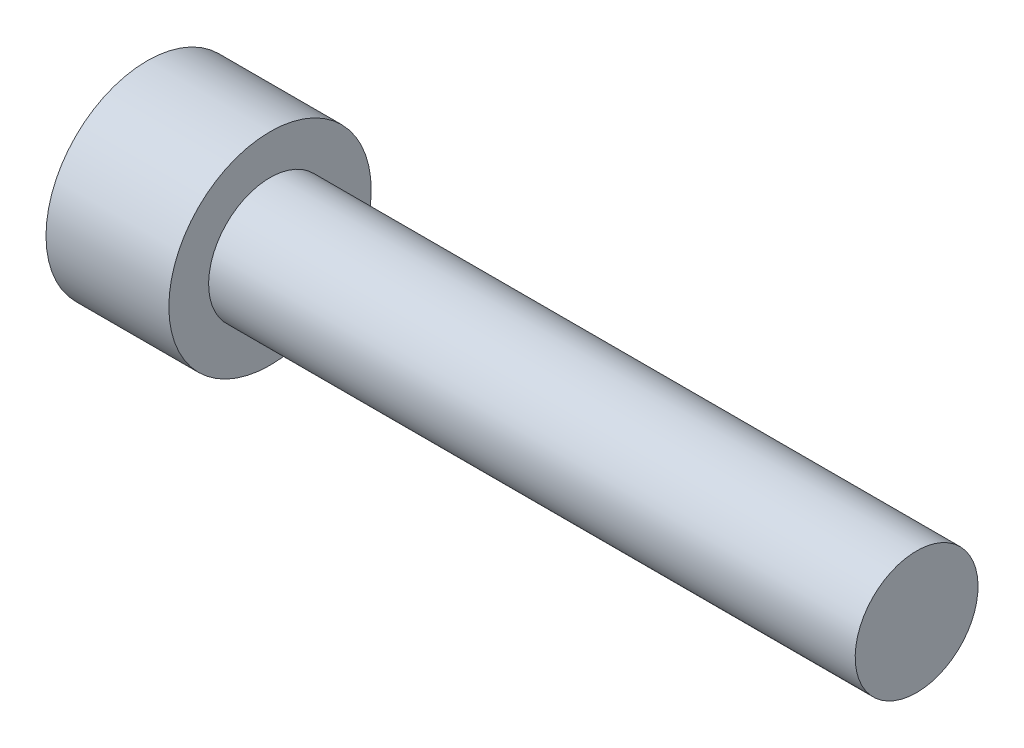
ISO-10303-21;
HEADER;
FILE_DESCRIPTION(('STEP AP214'),'2;1');
FILE_NAME('part.step','',(''),(''),'','','');
FILE_SCHEMA(('AUTOMOTIVE_DESIGN { 1 0 10303 214 1 1 1 1 }'));
ENDSEC;
DATA;
#1=APPLICATION_CONTEXT('core data for automotive mechanical design processes');
#2=APPLICATION_PROTOCOL_DEFINITION('international standard','automotive_design',2000,#1);
#3=PRODUCT_CONTEXT('',#1,'mechanical');
#4=PRODUCT('Part','Part','',(#3));
#5=PRODUCT_RELATED_PRODUCT_CATEGORY('part','',(#4));
#6=PRODUCT_DEFINITION_FORMATION('','',#4);
#7=PRODUCT_DEFINITION_CONTEXT('part definition',#1,'design');
#8=PRODUCT_DEFINITION('design','',#6,#7);
#9=PRODUCT_DEFINITION_SHAPE('','',#8);
#10=(LENGTH_UNIT() NAMED_UNIT(*) SI_UNIT(.MILLI.,.METRE.));
#11=(NAMED_UNIT(*) PLANE_ANGLE_UNIT() SI_UNIT($,.RADIAN.));
#12=(NAMED_UNIT(*) SI_UNIT($,.STERADIAN.) SOLID_ANGLE_UNIT());
#13=UNCERTAINTY_MEASURE_WITH_UNIT(LENGTH_MEASURE(1.E-05),#10,'distance_accuracy_value','');
#14=(GEOMETRIC_REPRESENTATION_CONTEXT(3) GLOBAL_UNCERTAINTY_ASSIGNED_CONTEXT((#13)) GLOBAL_UNIT_ASSIGNED_CONTEXT((#10,
#11,#12)) REPRESENTATION_CONTEXT('',''));
#15=CARTESIAN_POINT('',(0.,0.,0.));
#16=DIRECTION('',(0.,0.,1.));
#17=DIRECTION('',(1.,0.,0.));
#18=AXIS2_PLACEMENT_3D('',#15,#16,#17);
#19=CARTESIAN_POINT('',(30.226,0.,0.));
#20=DIRECTION('',(-1.,0.,0.));
#21=DIRECTION('',(0.,-1.,0.));
#22=AXIS2_PLACEMENT_3D('',#19,#20,#21);
#23=PLANE('',#22);
#24=CARTESIAN_POINT('',(30.226,0.,0.));
#25=DIRECTION('',(-1.,0.,0.));
#26=DIRECTION('',(0.,-1.,0.));
#27=AXIS2_PLACEMENT_3D('',#24,#25,#26);
#28=CIRCLE('',#27,2.413);
#29=CARTESIAN_POINT('',(30.226,-2.413,0.));
#30=VERTEX_POINT('',#29);
#31=EDGE_CURVE('E11',#30,#30,#28,.T.);
#32=ORIENTED_EDGE('',*,*,#31,.F.);
#33=EDGE_LOOP('',(#32));
#34=FACE_BOUND('',#33,.T.);
#35=ADVANCED_FACE('F28',(#34),#23,.F.);
#36=CARTESIAN_POINT('',(0.,0.,0.));
#37=DIRECTION('',(-1.,0.,0.));
#38=DIRECTION('',(0.,-1.,0.));
#39=AXIS2_PLACEMENT_3D('',#36,#37,#38);
#40=CYLINDRICAL_SURFACE('',#39,2.413);
#41=CARTESIAN_POINT('',(4.826,0.,0.));
#42=DIRECTION('',(-1.,0.,0.));
#43=DIRECTION('',(0.,-1.,0.));
#44=AXIS2_PLACEMENT_3D('',#41,#42,#43);
#45=CIRCLE('',#44,2.413);
#46=CARTESIAN_POINT('',(4.826,-2.413,0.));
#47=VERTEX_POINT('',#46);
#48=EDGE_CURVE('E35',#47,#47,#45,.T.);
#49=ORIENTED_EDGE('',*,*,#48,.F.);
#50=EDGE_LOOP('',(#49));
#51=FACE_BOUND('',#50,.T.);
#52=ORIENTED_EDGE('',*,*,#31,.T.);
#53=EDGE_LOOP('',(#52));
#54=FACE_BOUND('',#53,.T.);
#55=ADVANCED_FACE('F146',(#51,#54),#40,.T.);
#56=CARTESIAN_POINT('',(4.826,3.9751,0.));
#57=DIRECTION('',(-1.,0.,0.));
#58=DIRECTION('',(0.,-1.,0.));
#59=AXIS2_PLACEMENT_3D('',#56,#57,#58);
#60=PLANE('',#59);
#61=CARTESIAN_POINT('',(4.826,0.,0.));
#62=DIRECTION('',(-1.,0.,0.));
#63=DIRECTION('',(0.,-1.,0.));
#64=AXIS2_PLACEMENT_3D('',#61,#62,#63);
#65=CIRCLE('',#64,3.9751);
#66=CARTESIAN_POINT('',(4.826,-3.9751,0.));
#67=VERTEX_POINT('',#66);
#68=EDGE_CURVE('E139',#67,#67,#65,.T.);
#69=ORIENTED_EDGE('',*,*,#68,.F.);
#70=EDGE_LOOP('',(#69));
#71=FACE_BOUND('',#70,.T.);
#72=ORIENTED_EDGE('',*,*,#48,.T.);
#73=EDGE_LOOP('',(#72));
#74=FACE_BOUND('',#73,.T.);
#75=ADVANCED_FACE('F144',(#71,#74),#60,.F.);
#76=CARTESIAN_POINT('',(0.,0.,0.));
#77=DIRECTION('',(-1.,0.,0.));
#78=DIRECTION('',(0.,-1.,0.));
#79=AXIS2_PLACEMENT_3D('',#76,#77,#78);
#80=CYLINDRICAL_SURFACE('',#79,3.9751);
#81=CARTESIAN_POINT('',(0.,0.,0.));
#82=DIRECTION('',(-1.,0.,0.));
#83=DIRECTION('',(0.,-1.,0.));
#84=AXIS2_PLACEMENT_3D('',#81,#82,#83);
#85=CIRCLE('',#84,3.9751);
#86=CARTESIAN_POINT('',(0.,-3.9751,0.));
#87=VERTEX_POINT('',#86);
#88=EDGE_CURVE('E130',#87,#87,#85,.T.);
#89=ORIENTED_EDGE('',*,*,#88,.F.);
#90=EDGE_LOOP('',(#89));
#91=FACE_BOUND('',#90,.T.);
#92=ORIENTED_EDGE('',*,*,#68,.T.);
#93=EDGE_LOOP('',(#92));
#94=FACE_BOUND('',#93,.T.);
#95=ADVANCED_FACE('F164',(#91,#94),#80,.T.);
#96=CARTESIAN_POINT('',(0.,0.,0.));
#97=DIRECTION('',(1.,0.,0.));
#98=DIRECTION('',(0.,1.,0.));
#99=AXIS2_PLACEMENT_3D('',#96,#97,#98);
#100=PLANE('',#99);
#101=DIRECTION('',(0.,0.866025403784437,-0.500000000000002));
#102=VECTOR('',#101,1.);
#103=CARTESIAN_POINT('',(0.,1.9812,1.14384635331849));
#104=LINE('',#103,#102);
#105=CARTESIAN_POINT('',(0.,0.,2.28769270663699));
#106=VERTEX_POINT('',#105);
#107=CARTESIAN_POINT('',(0.,1.9812,1.14384635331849));
#108=VERTEX_POINT('',#107);
#109=EDGE_CURVE('E96',#106,#108,#104,.T.);
#110=ORIENTED_EDGE('',*,*,#109,.F.);
#111=DIRECTION('',(0.,0.866025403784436,0.500000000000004));
#112=VECTOR('',#111,1.);
#113=CARTESIAN_POINT('',(0.,-1.9812,1.14384635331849));
#114=LINE('',#113,#112);
#115=CARTESIAN_POINT('',(0.,-1.9812,1.14384635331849));
#116=VERTEX_POINT('',#115);
#117=EDGE_CURVE('E42',#116,#106,#114,.T.);
#118=ORIENTED_EDGE('',*,*,#117,.F.);
#119=DIRECTION('',(0.,0.,1.));
#120=VECTOR('',#119,1.);
#121=CARTESIAN_POINT('',(0.,-1.9812,1.14384635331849));
#122=LINE('',#121,#120);
#123=CARTESIAN_POINT('',(0.,-1.9812,-1.14384635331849));
#124=VERTEX_POINT('',#123);
#125=EDGE_CURVE('E112',#124,#116,#122,.T.);
#126=ORIENTED_EDGE('',*,*,#125,.F.);
#127=DIRECTION('',(0.,-0.866025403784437,0.500000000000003));
#128=VECTOR('',#127,1.);
#129=CARTESIAN_POINT('',(0.,-1.9812,-1.14384635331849));
#130=LINE('',#129,#128);
#131=CARTESIAN_POINT('',(0.,0.,-2.28769270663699));
#132=VERTEX_POINT('',#131);
#133=EDGE_CURVE('E106',#132,#124,#130,.T.);
#134=ORIENTED_EDGE('',*,*,#133,.F.);
#135=DIRECTION('',(0.,-0.866025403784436,-0.500000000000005));
#136=VECTOR('',#135,1.);
#137=CARTESIAN_POINT('',(0.,1.9812,-1.14384635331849));
#138=LINE('',#137,#136);
#139=CARTESIAN_POINT('',(0.,1.9812,-1.14384635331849));
#140=VERTEX_POINT('',#139);
#141=EDGE_CURVE('E104',#140,#132,#138,.T.);
#142=ORIENTED_EDGE('',*,*,#141,.F.);
#143=DIRECTION('',(0.,0.,-1.));
#144=VECTOR('',#143,1.);
#145=CARTESIAN_POINT('',(0.,1.9812,1.14384635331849));
#146=LINE('',#145,#144);
#147=EDGE_CURVE('E85',#108,#140,#146,.T.);
#148=ORIENTED_EDGE('',*,*,#147,.F.);
#149=EDGE_LOOP('',(#110,#118,#126,#134,#142,#148));
#150=FACE_BOUND('',#149,.T.);
#151=ORIENTED_EDGE('',*,*,#88,.T.);
#152=EDGE_LOOP('',(#151));
#153=FACE_BOUND('',#152,.T.);
#154=ADVANCED_FACE('F100',(#150,#153),#100,.F.);
#155=CARTESIAN_POINT('',(2.54,-1.9812,1.14384635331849));
#156=DIRECTION('',(0.,-0.500000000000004,0.866025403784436));
#157=DIRECTION('',(0.,-0.866025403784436,-0.500000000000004));
#158=AXIS2_PLACEMENT_3D('',#155,#156,#157);
#159=PLANE('',#158);
#160=ORIENTED_EDGE('',*,*,#117,.T.);
#161=DIRECTION('',(-1.,0.,0.));
#162=VECTOR('',#161,1.);
#163=CARTESIAN_POINT('',(2.54,0.,2.28769270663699));
#164=LINE('',#163,#162);
#165=CARTESIAN_POINT('',(2.54,0.,2.28769270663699));
#166=VERTEX_POINT('',#165);
#167=EDGE_CURVE('E93',#166,#106,#164,.T.);
#168=ORIENTED_EDGE('',*,*,#167,.F.);
#169=DIRECTION('',(0.,0.866025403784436,0.500000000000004));
#170=VECTOR('',#169,1.);
#171=CARTESIAN_POINT('',(2.54,-1.9812,1.14384635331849));
#172=LINE('',#171,#170);
#173=CARTESIAN_POINT('',(2.54,-1.9812,1.14384635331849));
#174=VERTEX_POINT('',#173);
#175=EDGE_CURVE('E114',#174,#166,#172,.T.);
#176=ORIENTED_EDGE('',*,*,#175,.F.);
#177=DIRECTION('',(-1.,0.,0.));
#178=VECTOR('',#177,1.);
#179=CARTESIAN_POINT('',(2.54,-1.9812,1.14384635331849));
#180=LINE('',#179,#178);
#181=EDGE_CURVE('E49',#174,#116,#180,.T.);
#182=ORIENTED_EDGE('',*,*,#181,.T.);
#183=EDGE_LOOP('',(#160,#168,#176,#182));
#184=FACE_BOUND('',#183,.T.);
#185=ADVANCED_FACE('F179',(#184),#159,.F.);
#186=CARTESIAN_POINT('',(2.54,-1.9812,1.14384635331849));
#187=DIRECTION('',(0.,-1.,0.));
#188=DIRECTION('',(1.,0.,0.));
#189=AXIS2_PLACEMENT_3D('',#186,#187,#188);
#190=PLANE('',#189);
#191=ORIENTED_EDGE('',*,*,#125,.T.);
#192=ORIENTED_EDGE('',*,*,#181,.F.);
#193=DIRECTION('',(0.,0.,1.));
#194=VECTOR('',#193,1.);
#195=CARTESIAN_POINT('',(2.54,-1.9812,1.14384635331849));
#196=LINE('',#195,#194);
#197=CARTESIAN_POINT('',(2.54,-1.9812,-1.14384635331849));
#198=VERTEX_POINT('',#197);
#199=EDGE_CURVE('E126',#198,#174,#196,.T.);
#200=ORIENTED_EDGE('',*,*,#199,.F.);
#201=DIRECTION('',(-1.,0.,0.));
#202=VECTOR('',#201,1.);
#203=CARTESIAN_POINT('',(2.54,-1.9812,-1.14384635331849));
#204=LINE('',#203,#202);
#205=EDGE_CURVE('E131',#198,#124,#204,.T.);
#206=ORIENTED_EDGE('',*,*,#205,.T.);
#207=EDGE_LOOP('',(#191,#192,#200,#206));
#208=FACE_BOUND('',#207,.T.);
#209=ADVANCED_FACE('F186',(#208),#190,.F.);
#210=CARTESIAN_POINT('',(2.54,-1.9812,-1.14384635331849));
#211=DIRECTION('',(0.,-0.500000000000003,-0.866025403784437));
#212=DIRECTION('',(0.,0.866025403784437,-0.500000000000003));
#213=AXIS2_PLACEMENT_3D('',#210,#211,#212);
#214=PLANE('',#213);
#215=ORIENTED_EDGE('',*,*,#133,.T.);
#216=ORIENTED_EDGE('',*,*,#205,.F.);
#217=DIRECTION('',(0.,-0.866025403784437,0.500000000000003));
#218=VECTOR('',#217,1.);
#219=CARTESIAN_POINT('',(2.54,-1.9812,-1.14384635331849));
#220=LINE('',#219,#218);
#221=CARTESIAN_POINT('',(2.54,0.,-2.28769270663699));
#222=VERTEX_POINT('',#221);
#223=EDGE_CURVE('E123',#222,#198,#220,.T.);
#224=ORIENTED_EDGE('',*,*,#223,.F.);
#225=DIRECTION('',(-1.,0.,0.));
#226=VECTOR('',#225,1.);
#227=CARTESIAN_POINT('',(2.54,0.,-2.28769270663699));
#228=LINE('',#227,#226);
#229=EDGE_CURVE('E133',#222,#132,#228,.T.);
#230=ORIENTED_EDGE('',*,*,#229,.T.);
#231=EDGE_LOOP('',(#215,#216,#224,#230));
#232=FACE_BOUND('',#231,.T.);
#233=ADVANCED_FACE('F193',(#232),#214,.F.);
#234=CARTESIAN_POINT('',(2.54,1.9812,-1.14384635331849));
#235=DIRECTION('',(0.,0.500000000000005,-0.866025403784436));
#236=DIRECTION('',(0.,0.866025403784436,0.500000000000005));
#237=AXIS2_PLACEMENT_3D('',#234,#235,#236);
#238=PLANE('',#237);
#239=ORIENTED_EDGE('',*,*,#141,.T.);
#240=ORIENTED_EDGE('',*,*,#229,.F.);
#241=DIRECTION('',(0.,-0.866025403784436,-0.500000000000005));
#242=VECTOR('',#241,1.);
#243=CARTESIAN_POINT('',(2.54,1.9812,-1.14384635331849));
#244=LINE('',#243,#242);
#245=CARTESIAN_POINT('',(2.54,1.9812,-1.14384635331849));
#246=VERTEX_POINT('',#245);
#247=EDGE_CURVE('E120',#246,#222,#244,.T.);
#248=ORIENTED_EDGE('',*,*,#247,.F.);
#249=DIRECTION('',(-1.,0.,0.));
#250=VECTOR('',#249,1.);
#251=CARTESIAN_POINT('',(2.54,1.9812,-1.14384635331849));
#252=LINE('',#251,#250);
#253=EDGE_CURVE('E92',#246,#140,#252,.T.);
#254=ORIENTED_EDGE('',*,*,#253,.T.);
#255=EDGE_LOOP('',(#239,#240,#248,#254));
#256=FACE_BOUND('',#255,.T.);
#257=ADVANCED_FACE('F200',(#256),#238,.F.);
#258=CARTESIAN_POINT('',(2.54,1.9812,1.14384635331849));
#259=DIRECTION('',(0.,1.,0.));
#260=DIRECTION('',(0.,0.,1.));
#261=AXIS2_PLACEMENT_3D('',#258,#259,#260);
#262=PLANE('',#261);
#263=ORIENTED_EDGE('',*,*,#147,.T.);
#264=ORIENTED_EDGE('',*,*,#253,.F.);
#265=DIRECTION('',(0.,0.,-1.));
#266=VECTOR('',#265,1.);
#267=CARTESIAN_POINT('',(2.54,1.9812,1.14384635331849));
#268=LINE('',#267,#266);
#269=CARTESIAN_POINT('',(2.54,1.9812,1.14384635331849));
#270=VERTEX_POINT('',#269);
#271=EDGE_CURVE('E88',#270,#246,#268,.T.);
#272=ORIENTED_EDGE('',*,*,#271,.F.);
#273=DIRECTION('',(-1.,0.,0.));
#274=VECTOR('',#273,1.);
#275=CARTESIAN_POINT('',(2.54,1.9812,1.14384635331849));
#276=LINE('',#275,#274);
#277=EDGE_CURVE('E81',#270,#108,#276,.T.);
#278=ORIENTED_EDGE('',*,*,#277,.T.);
#279=EDGE_LOOP('',(#263,#264,#272,#278));
#280=FACE_BOUND('',#279,.T.);
#281=ADVANCED_FACE('F83',(#280),#262,.F.);
#282=CARTESIAN_POINT('',(2.54,1.9812,1.14384635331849));
#283=DIRECTION('',(0.,0.500000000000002,0.866025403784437));
#284=DIRECTION('',(0.,-0.866025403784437,0.500000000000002));
#285=AXIS2_PLACEMENT_3D('',#282,#283,#284);
#286=PLANE('',#285);
#287=ORIENTED_EDGE('',*,*,#109,.T.);
#288=ORIENTED_EDGE('',*,*,#277,.F.);
#289=DIRECTION('',(0.,0.866025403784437,-0.500000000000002));
#290=VECTOR('',#289,1.);
#291=CARTESIAN_POINT('',(2.54,1.9812,1.14384635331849));
#292=LINE('',#291,#290);
#293=EDGE_CURVE('E117',#166,#270,#292,.T.);
#294=ORIENTED_EDGE('',*,*,#293,.F.);
#295=ORIENTED_EDGE('',*,*,#167,.T.);
#296=EDGE_LOOP('',(#287,#288,#294,#295));
#297=FACE_BOUND('',#296,.T.);
#298=ADVANCED_FACE('F97',(#297),#286,.F.);
#299=CARTESIAN_POINT('',(2.54,-3.96239999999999,0.));
#300=DIRECTION('',(-1.,0.,0.));
#301=DIRECTION('',(0.,-1.,0.));
#302=AXIS2_PLACEMENT_3D('',#299,#300,#301);
#303=PLANE('',#302);
#304=ORIENTED_EDGE('',*,*,#175,.T.);
#305=ORIENTED_EDGE('',*,*,#293,.T.);
#306=ORIENTED_EDGE('',*,*,#271,.T.);
#307=ORIENTED_EDGE('',*,*,#247,.T.);
#308=ORIENTED_EDGE('',*,*,#223,.T.);
#309=ORIENTED_EDGE('',*,*,#199,.T.);
#310=EDGE_LOOP('',(#304,#305,#306,#307,#308,#309));
#311=FACE_BOUND('',#310,.T.);
#312=ADVANCED_FACE('F221',(#311),#303,.T.);
#313=CLOSED_SHELL('',(#35,#55,#75,#95,#154,#185,#209,#233,#257,#281,#298,#312));
#314=MANIFOLD_SOLID_BREP('B2',#313);
#315=ADVANCED_BREP_SHAPE_REPRESENTATION('',(#18,#314),#14);
#316=SHAPE_DEFINITION_REPRESENTATION(#9,#315);
ENDSEC;
END-ISO-10303-21;
